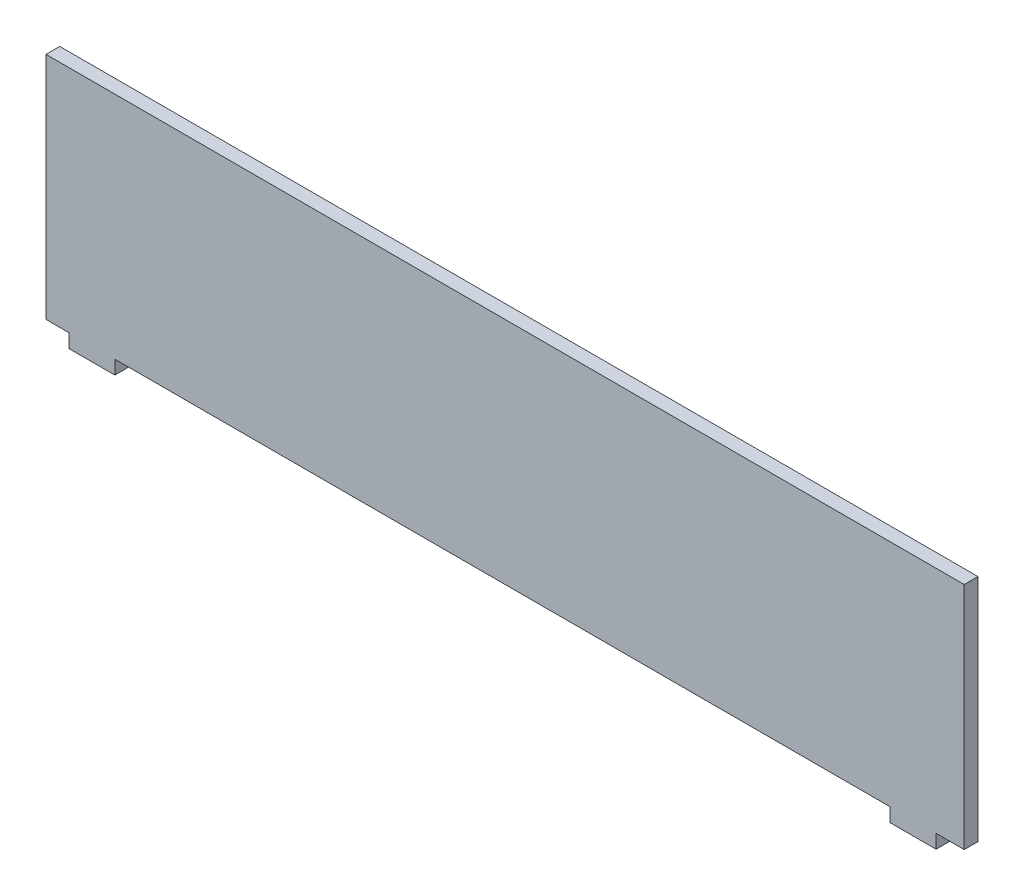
from build123d import *

# Parameters (mm, degrees)
RESSALTO_EXTRUS_O1_DEPTH = 3


with BuildPart() as part:
    # Esbo_o2 → Ressalto-extrus_o1 (new body)
    with BuildSketch(Plane.XY):
        Polygon((-62.490658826, 33.134581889), (137.509341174, 33.134581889), (137.509341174, -16.865418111), (131.379341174, -16.865418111), (131.379341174, -19.865418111), (121.379341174, -19.865418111), (121.379341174, -16.865418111), (-47.490658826, -16.865418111), (-47.490658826, -19.865418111), (-57.490658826, -19.865418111), (-57.490658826, -16.865418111), (-62.490658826, -16.865418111), align=None)
    extrude(amount=RESSALTO_EXTRUS_O1_DEPTH)


solid = part.part
